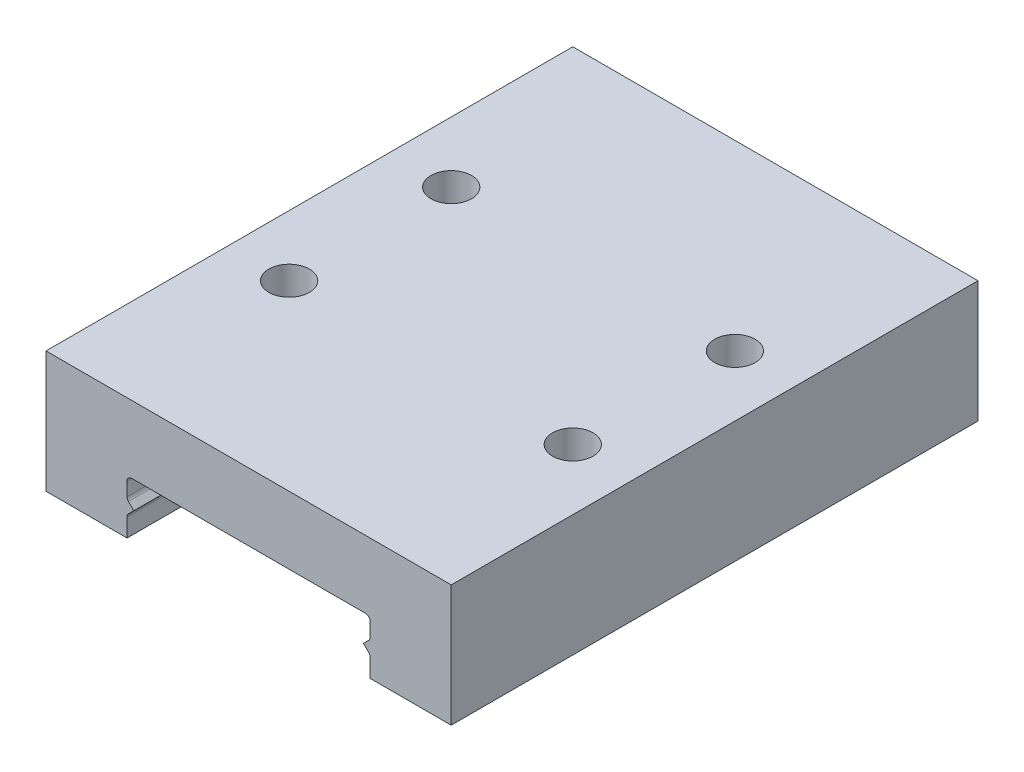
from build123d import *

# Parameters (mm, degrees)
SKETCH1_W            = 30
SKETCH1_H            = 9
EXTRUDE1_DEPTH       = 39
CUT_EXTRUDE1_DEPTH   = 44.474130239
FILLET1_R            = 0.35
FILLET1_OF_MIRROR1_R = 0.35
LPATTERN2_COUNT      = 2
LPATTERN2_PITCH      = 12
LPATTERN2_COUNT_DIR2 = 2
LPATTERN2_PITCH_DIR2 = 21


with BuildPart() as part:
    # Sketch1 → Extrude1 (new body)
    with BuildSketch(Plane.XY):
        with Locations((0, 7.5)):
            Rectangle(SKETCH1_W, SKETCH1_H)
    extrude(amount=EXTRUDE1_DEPTH)

    # Sketch2 → Cut-Extrude1 (cut, through all)
    with BuildSketch(Plane(origin=(0, 0, 0), x_dir=(-1, 0, 0), z_dir=(0, 0, -1))):
        Polygon((8.5, 5), (9, 4.5), (9, 0.830210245), (0, 0.830210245), (0, 7), (9, 7), (9, 5.5), align=None)
    cut_extrude1 = extrude(amount=-CUT_EXTRUDE1_DEPTH, mode=Mode.SUBTRACT)

    # Fillet1
    fillet1_edges = [part.edges().sort_by_distance(p)[0] for p in [
        (-9, 4.5, 19.5),
        (-9, 7, 19.5),
        (-9, 5.5, 19.5),
    ]]
    fillet(fillet1_edges, radius=FILLET1_R)

    # Mirror1: Cut-Extrude1 across plane
    add(cut_extrude1.mirror(Plane(origin=(0, 0, 0), x_dir=(0, 0, 1), z_dir=(1, 0, 0))), mode=Mode.SUBTRACT)

    # Fillet1 of Mirror1
    fillet1_of_mirror1_edges = [part.edges().sort_by_distance(p)[0] for p in [
        (9, 4.5, 19.5),
        (9, 7, 19.5),
        (9, 5.5, 19.5),
    ]]
    fillet(fillet1_of_mirror1_edges, radius=FILLET1_OF_MIRROR1_R)

    # Sketch3 → M3x0.5 Tapped Hole1 (revolve, cut)
    with BuildSketch(Plane(origin=(-10.5, 12, 13.5), x_dir=(0, 0, 1), z_dir=(1, 0, 0))):
        Polygon((0, 0), (0, 5.251075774), (1.25, 4.5), (1.25, 3), (1.5, 3), (1.5, 0), align=None)
    m3x0_5_tapped_hole1 = revolve(axis=Axis((-10.5, 18.35, 13.5), (0, -1, 0)), mode=Mode.SUBTRACT)

    # LPattern2: M3x0.5 Tapped Hole1 2 × 2
    with Locations(*[(j * LPATTERN2_PITCH_DIR2, 0, i * LPATTERN2_PITCH) for i in range(LPATTERN2_COUNT) for j in range(LPATTERN2_COUNT_DIR2) if (i, j) != (0, 0)]):
        add(m3x0_5_tapped_hole1, mode=Mode.SUBTRACT)


solid = part.part
